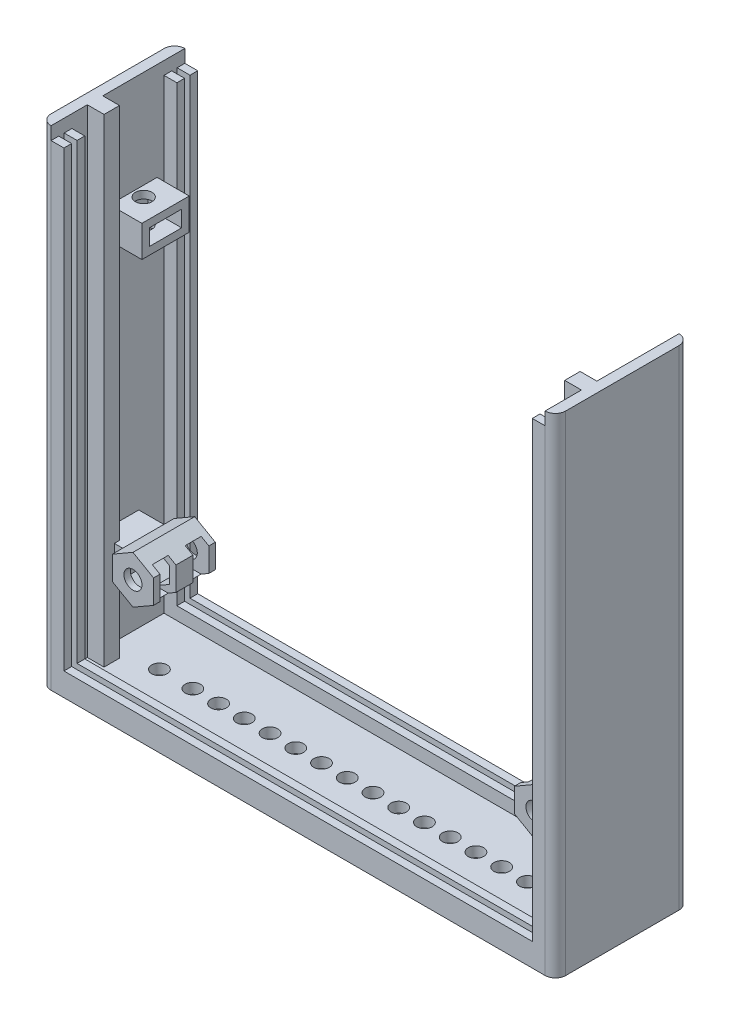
from build123d import *

# Parameters (mm, degrees)
BOSS_EXTRUDE1_DEPTH             = 26
SKETCH2_W                       = 49.25
SKETCH2_H                       = 1.05
CUT_EXTRUDE1_DEPTH              = 95.5
SKETCH3_W                       = 2
SKETCH3_H                       = 3
BOSS_EXTRUDE2_DEPTH             = 93
SKETCH9_R                       = 1.5
CUT_EXTRUDE8_DEPTH              = 113.006975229
SKETCH11_W                      = 26
SKETCH11_H                      = 97
CUT_EXTRUDE9_DEPTH              = 0.25
SKETCH12_W                      = 26
SKETCH12_H                      = 97
CUT_EXTRUDE10_DEPTH             = 0.25
SKETCH15_W                      = 4
SKETCH15_H                      = 40
CUT_EXTRUDE12_DEPTH             = 116.226949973
SKETCH16_W                      = 26
SKETCH16_H                      = 57
CUT_EXTRUDE13_DEPTH             = 1.5
SKETCH17_W                      = 26
SKETCH17_H                      = 57
CUT_EXTRUDE14_DEPTH             = 1.5
SKETCH30_W                      = 2.5
SKETCH30_H                      = 26
CUT_EXTRUDE20_DEPTH             = 84.366660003
SKETCH31_W                      = 2.5
SKETCH31_H                      = 26
CUT_EXTRUDE21_DEPTH             = 84.366660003
BOSS_EXTRUDE4_DEPTH             = 97
MIRROR4_COPY_1_DEPTH            = 97
SKETCH33_W                      = 26
SKETCH33_H                      = 97
CUT_EXTRUDE22_DEPTH             = 2.5
SKETCH34_W                      = 26
SKETCH34_H                      = 97
CUT_EXTRUDE23_DEPTH             = 2.5
BOSS_EXTRUDE5_REACH             = 140.583
BOSS_EXTRUDE5_DIRECTION_2_REACH = 140.583
SKETCH38_W                      = 100
SKETCH38_H                      = 26
CUT_EXTRUDE26_DEPTH             = 2
FILLET1_R                       = 2
BOSS_EXTRUDE8_DEPTH             = 12
BOSS_EXTRUDE9_REACH             = 138.853
SKETCH43_W                      = 8
SKETCH43_H                      = 4.618802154
BOSS_EXTRUDE11_DEPTH            = 1.25
BOSS_EXTRUDE11_DEPTH_BACK       = 5.1
SKETCH47_W                      = 3.1
SKETCH47_H                      = 6.35
CUT_EXTRUDE29_DEPTH             = 3.999997
CUT_EXTRUDE30_DEPTH             = 3.1
SKETCH50_R                      = 1.75
CUT_EXTRUDE31_DEPTH             = 111.761466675
BOSS_EXTRUDE12_DEPTH            = 5.65
SKETCH52_R                      = 1.75
CUT_EXTRUDE32_DEPTH             = 111.778619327
CUT_EXTRUDE33_DEPTH             = 3.1
BOSS_EXTRUDE13_DEPTH            = 12
SKETCH55_W                      = 8
SKETCH55_H                      = 4.618802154
BOSS_EXTRUDE14_DEPTH            = 4.866002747
SKETCH56_W                      = 3.1
SKETCH56_H                      = 6.35
CUT_EXTRUDE34_DEPTH             = 4.000003
BOSS_EXTRUDE15_DEPTH            = 1.25
BOSS_EXTRUDE16_DEPTH            = 1.25
SKETCH59_R                      = 1.75
CUT_EXTRUDE35_DEPTH             = 111.778619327
BOSS_EXTRUDE17_DEPTH            = 1.25
BOSS_EXTRUDE18_DEPTH            = 1.25
SKETCH63_W                      = 6.25
SKETCH63_H                      = 9.2
BOSS_EXTRUDE19_DEPTH            = 6.1
SKETCH64_R                      = 1.6
CUT_EXTRUDE36_DEPTH             = 6.1
SKETCH66_W                      = 6.25
SKETCH66_H                      = 3.15
CUT_EXTRUDE37_DEPTH             = 6.5
SKETCH68_W                      = 6.25
SKETCH68_H                      = 3.15
CUT_EXTRUDE38_DEPTH             = 6.5
SKETCH71_W                      = 6.25
SKETCH71_H                      = 3.15
CUT_EXTRUDE39_DEPTH             = 7
SKETCH73_W                      = 2.5
SKETCH73_H                      = 4.05
CUT_EXTRUDE40_DEPTH             = 2.5


with BuildPart() as part:
    # Sketch1 → Boss-Extrude1 (new body)
    with BuildSketch(Plane.XY):
        Polygon((-56.75, 97), (-56.75, 0), (0, 0), (0, 4), (-48, 4), (-48, 97), align=None)
    extrude(amount=BOSS_EXTRUDE1_DEPTH)

    # Sketch2 → Cut-Extrude1 (cut)
    with BuildSketch(Plane(origin=(0, 97, 0), x_dir=(1, 0, 0), z_dir=(0, 1, 0))):
        with Locations((-24.625, -23.975)):
            Rectangle(SKETCH2_W, SKETCH2_H)
    cut_extrude1 = extrude(amount=-CUT_EXTRUDE1_DEPTH, mode=Mode.SUBTRACT)

    # Mirror1: Cut-Extrude1 across plane
    add(cut_extrude1.mirror(Plane.XY.offset(13)), mode=Mode.SUBTRACT)

    # Sketch3 → Boss-Extrude2 (add)
    with BuildSketch(Plane(origin=(0, 97, 0), x_dir=(1, 0, 0), z_dir=(0, 1, 0))):
        with Locations((-47, -17.45)):
            Rectangle(SKETCH3_W, SKETCH3_H)
    extrude(amount=-BOSS_EXTRUDE2_DEPTH)

    # Mirror2: part across plane


with BuildPart() as part_1:
    add(part.part)
    add(part.part.mirror(Plane(origin=(0, 0, 26), x_dir=(0, 0, 1), z_dir=(-1, 0, 0))))

    # Sketch9 → Cut-Extrude8 (cut, through all)
    with BuildSketch(Plane(origin=(0, 4, 0), x_dir=(1, 0, 0), z_dir=(0, 1, 0))):
        with Locations(Location((42.5, -13.95, 0), (0, 0, 180))):
            Circle(SKETCH9_R)
        with Locations(Location((37.5, -13.95, 0), (0, 0, 180))):
            Circle(SKETCH9_R)
        with Locations(Location((32.5, -13.95, 0), (0, 0, 180))):
            Circle(SKETCH9_R)
        with Locations(Location((27.5, -13.95, 0), (0, 0, 180))):
            Circle(SKETCH9_R)
        with Locations(Location((22.5, -13.95, 0), (0, 0, 180))):
            Circle(SKETCH9_R)
        with Locations(Location((17.5, -13.95, 0), (0, 0, 180))):
            Circle(SKETCH9_R)
        with Locations(Location((12.5, -13.95, 0), (0, 0, 180))):
            Circle(SKETCH9_R)
        with Locations(Location((7.5, -13.95, 0), (0, 0, 180))):
            Circle(SKETCH9_R)
        with Locations(Location((2.5, -13.95, 0), (0, 0, 180))):
            Circle(SKETCH9_R)
        with Locations(Location((-2.5, -13.95, 0), (0, 0, 180))):
            Circle(SKETCH9_R)
        with Locations(Location((-7.5, -13.95, 0), (0, 0, 180))):
            Circle(SKETCH9_R)
        with Locations(Location((-12.5, -13.95, 0), (0, 0, 180))):
            Circle(SKETCH9_R)
        with Locations(Location((-17.5, -13.95, 0), (0, 0, 180))):
            Circle(SKETCH9_R)
        with Locations(Location((-22.5, -13.95, 0), (0, 0, 180))):
            Circle(SKETCH9_R)
        with Locations(Location((-27.5, -13.95, 0), (0, 0, 180))):
            Circle(SKETCH9_R)
        with Locations(Location((-32.5, -13.95, 0), (0, 0, 180))):
            Circle(SKETCH9_R)
        with Locations(Location((-39, -13.95, 0), (0, 0, 180))):
            Circle(SKETCH9_R)
    extrude(amount=-CUT_EXTRUDE8_DEPTH, mode=Mode.SUBTRACT)

    # Sketch11 → Cut-Extrude9 (cut)
    with BuildSketch(Plane.ZY.offset(56.75)):
        with Locations((13, 48.5)):
            Rectangle(SKETCH11_W, SKETCH11_H)
    extrude(amount=-CUT_EXTRUDE9_DEPTH, mode=Mode.SUBTRACT)

    # Sketch12 → Cut-Extrude10 (cut)
    with BuildSketch(Plane(origin=(56.75, 0, 0), x_dir=(0, 0, -1), z_dir=(1, 0, 0))):
        with Locations((-13, 48.5)):
            Rectangle(SKETCH12_W, SKETCH12_H)
    extrude(amount=-CUT_EXTRUDE10_DEPTH, mode=Mode.SUBTRACT)

    # Sketch15 → Cut-Extrude12 (cut, through all)
    with BuildSketch(Plane.XY.offset(26)):
        with Locations((54.5, 77)):
            Rectangle(SKETCH15_W, SKETCH15_H)
        with Locations((-54.5, 77)):
            Rectangle(SKETCH15_W, SKETCH15_H)
    extrude(amount=-CUT_EXTRUDE12_DEPTH, mode=Mode.SUBTRACT)

    # Sketch16 → Cut-Extrude13 (cut)
    with BuildSketch(Plane(origin=(56.5, 0, 0), x_dir=(0, 0, -1), z_dir=(1, 0, 0))):
        with Locations((-13, 28.5)):
            Rectangle(SKETCH16_W, SKETCH16_H)
    extrude(amount=-CUT_EXTRUDE13_DEPTH, mode=Mode.SUBTRACT)

    # Sketch17 → Cut-Extrude14 (cut)
    with BuildSketch(Plane.ZY.offset(56.5)):
        with Locations((13, 28.5)):
            Rectangle(SKETCH17_W, SKETCH17_H)
    extrude(amount=-CUT_EXTRUDE14_DEPTH, mode=Mode.SUBTRACT)

    # Sketch30 → Cut-Extrude20 (cut, through all)
    with BuildSketch(Plane(origin=(0, 57, 0), x_dir=(1, 0, 0), z_dir=(0, 1, 0))):
        with Locations((53.75, -13)):
            Rectangle(SKETCH30_W, SKETCH30_H)
    extrude(amount=-CUT_EXTRUDE20_DEPTH, mode=Mode.SUBTRACT)

    # Sketch31 → Cut-Extrude21 (cut, through all)
    with BuildSketch(Plane(origin=(0, 57, 0), x_dir=(1, 0, 0), z_dir=(0, 1, 0))):
        with Locations((-53.75, -13)):
            Rectangle(SKETCH31_W, SKETCH31_H)
    extrude(amount=-CUT_EXTRUDE21_DEPTH, mode=Mode.SUBTRACT)

    # Sketch32 → Boss-Extrude4 (add, through all)
    with BuildSketch(Plane(origin=(0, 97, 0), x_dir=(1, 0, 0), z_dir=(0, 1, 0))):
        Polygon((-45.5, -24.5), (-45.5, -26), (-49.25, -26), (-49.25, -24.5), (-49.25, -23.975), (-49.25, -23.45), (-49.25, -21.95), (-45.5, -21.95), (-45.5, -23.45), (-48, -23.45), (-48, -24.5), align=None)
    boss_extrude4 = extrude(amount=-BOSS_EXTRUDE4_DEPTH)

    # Mirror3: Boss-Extrude4 across plane
    add(boss_extrude4.mirror(Plane.XY.offset(13)))

    # Mirror4: Boss-Extrude4 across plane
    add(boss_extrude4.mirror(Plane(origin=(0, 0, 0), x_dir=(0, 0, 1), z_dir=(1, 0, 0))))

    # Mirror4 copy 1 sketch → Mirror4 copy 1 (add, through all)
    with BuildSketch(Plane(origin=(0, 97, 26), x_dir=(-1, 0, 0), z_dir=(0, 1, 0))):
        Polygon((-45.5, -24.5), (-45.5, -26), (-49.25, -26), (-49.25, -24.5), (-49.25, -23.975), (-49.25, -23.45), (-49.25, -21.95), (-45.5, -21.95), (-45.5, -23.45), (-48, -23.45), (-48, -24.5), align=None)
    extrude(amount=-MIRROR4_COPY_1_DEPTH)

    # Sketch33 → Cut-Extrude22 (cut)
    with BuildSketch(Plane.ZY.offset(52.5)):
        with Locations((13, 48.5)):
            Rectangle(SKETCH33_W, SKETCH33_H)
    extrude(amount=-CUT_EXTRUDE22_DEPTH, mode=Mode.SUBTRACT)

    # Sketch34 → Cut-Extrude23 (cut)
    with BuildSketch(Plane(origin=(52.5, 0, 0), x_dir=(0, 0, -1), z_dir=(1, 0, 0))):
        with Locations((-13, 48.5)):
            Rectangle(SKETCH34_W, SKETCH34_H)
    extrude(amount=-CUT_EXTRUDE23_DEPTH, mode=Mode.SUBTRACT)

    # Boss-Extrude5: up to this face of the body (flat: up to its plane)
    boss_extrude5_end = Plane(part_1.part.faces().sort_by_distance((48, 49.25, 23.975))[0])
    # Sketch35 → Boss-Extrude5 (add, up to the picked face)
    with BuildSketch(Plane(origin=(-45.5, 0, 0), x_dir=(0, 0, -1), z_dir=(1, 0, 0)), mode=Mode.PRIVATE) as boss_extrude5_sk1:
        Polygon((-26, 6.5), (-26, 0), (-21.95, 0), (-21.95, 6.5), (-23.45, 6.5), (-23.45, 4), (-24.5, 4), (-24.5, 6.5), align=None)
    boss_extrude5_tool1 = split(extrude(boss_extrude5_sk1.sketch, amount=BOSS_EXTRUDE5_REACH, mode=Mode.PRIVATE), bisect_by=boss_extrude5_end, keep=Keep.BOTH, mode=Mode.PRIVATE)
    boss_extrude5 = boss_extrude5_tool1.solids().sort_by(Axis((-45.5, 3.028481, 23.975), (1, 0, 0)))[0]
    add(boss_extrude5)

    # Boss-Extrude5 direction 2: up to this face of the body (flat: up to its plane)
    boss_extrude5_direction_2_end = Plane(part_1.part.faces().sort_by_distance((-48, 49.25, 23.975))[0])
    # Sketch35 → Boss-Extrude5 direction 2 (add, up to the picked face)
    with BuildSketch(Plane(origin=(-45.5, 0, 0), x_dir=(0, 0, -1), z_dir=(1, 0, 0)), mode=Mode.PRIVATE) as boss_extrude5_direction_2_sk1:
        Polygon((-26, 6.5), (-26, 0), (-21.95, 0), (-21.95, 6.5), (-23.45, 6.5), (-23.45, 4), (-24.5, 4), (-24.5, 6.5), align=None)
    boss_extrude5_direction_2_tool1 = split(extrude(boss_extrude5_direction_2_sk1.sketch, amount=-BOSS_EXTRUDE5_DIRECTION_2_REACH, mode=Mode.PRIVATE), bisect_by=boss_extrude5_direction_2_end, keep=Keep.BOTH, mode=Mode.PRIVATE)
    boss_extrude5_direction_2 = boss_extrude5_direction_2_tool1.solids().sort_by(Axis((-45.5, 3.028481, 23.975), (-1, 0, 0)))[0]
    add(boss_extrude5_direction_2)

    # Mirror5: Boss-Extrude5, Boss-Extrude5 direction 2 across plane
    add(boss_extrude5.mirror(Plane.XY.offset(13)))
    add(boss_extrude5_direction_2.mirror(Plane.XY.offset(13)))

    # Sketch38 → Cut-Extrude26 (cut)
    with BuildSketch(Plane.XZ):
        with Locations((0, 13)):
            Rectangle(SKETCH38_W, SKETCH38_H)
    extrude(amount=-CUT_EXTRUDE26_DEPTH, mode=Mode.SUBTRACT)

    # Fillet1
    fillet1_edges = [part_1.edges().sort_by_distance(p)[0] for p in [
        (-50, 49.5, 0),
        (50, 49.5, 26),
        (50, 49.5, 0),
        (-50, 49.5, 26),
    ]]
    fillet(fillet1_edges, radius=FILLET1_R)

    # Boss-Extrude9: up to this face of the body (flat: up to its plane)
    boss_extrude9_end = Plane(part_1.part.faces().sort_by_distance((48, 50.5, 10))[0])
    # Sketch43 → Boss-Extrude9 (add, up to the picked face)
    with BuildSketch(Plane(origin=(42.971002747, 0, 0), x_dir=(0, 0, -1), z_dir=(1, 0, 0)), mode=Mode.PRIVATE) as boss_extrude9_sk1:
        with Locations((-12.95, 21.505999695)):
            Rectangle(SKETCH43_W, SKETCH43_H)
    boss_extrude9_tool1 = split(extrude(boss_extrude9_sk1.sketch, amount=BOSS_EXTRUDE9_REACH, mode=Mode.PRIVATE), bisect_by=boss_extrude9_end, keep=Keep.BOTH, mode=Mode.PRIVATE)


with BuildPart() as body_2:
    # Sketch42 → Boss-Extrude8 (new body)
    with BuildSketch(Plane.XY.offset(18.95)):
        Polygon((42.971002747, 23.815400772), (38.971002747, 26.124801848), (34.971002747, 23.815400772), (34.971002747, 19.196598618), (38.971002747, 16.887197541), (42.971002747, 19.196598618), align=None)
        Polygon((41.721002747, 23.093712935), (38.971002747, 24.681426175), (36.221002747, 23.093712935), (36.221002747, 19.918286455), (38.971002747, 18.330573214), (41.721002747, 19.918286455), align=None, mode=Mode.SUBTRACT)
    extrude(amount=-BOSS_EXTRUDE8_DEPTH)


with BuildPart() as part_2:
    add(part_1.part)

    add(body_2.part)  # Boss-Extrude9 merges body 2
    add(boss_extrude9_tool1.solids().sort_by(Axis((42.971003, 21.506, 12.95), (1, 0, 0)))[0])

    # Sketch48 → Boss-Extrude11 (add, two sides: drawn at the far end of the back side and taken through both)
    with BuildSketch(Plane.XY.offset(17.7).offset(-BOSS_EXTRUDE11_DEPTH_BACK)):
        Polygon((38.971002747, 24.681426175), (36.221002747, 23.093712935), (36.221002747, 19.918286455), (38.971002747, 18.330573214), (41.721002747, 19.918286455), (41.721002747, 23.093712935), align=None)
    extrude(amount=BOSS_EXTRUDE11_DEPTH + BOSS_EXTRUDE11_DEPTH_BACK)

    # Sketch47 → Cut-Extrude29 (cut)
    with BuildSketch(Plane.ZY.offset(-34.971002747)):
        with Locations((16.15, 21.505999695)):
            Rectangle(SKETCH47_W, SKETCH47_H)
        with Locations((9.75, 21.505999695)):
            Rectangle(SKETCH47_W, SKETCH47_H)
    extrude(amount=-CUT_EXTRUDE29_DEPTH, mode=Mode.SUBTRACT)

    # Sketch49 → Cut-Extrude30 (cut)
    with BuildSketch(Plane.XY.offset(14.6)):
        Polygon((38.971002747, 24.681426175), (36.221002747, 23.093712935), (36.221002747, 19.918286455), (38.971002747, 18.330573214), (41.721002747, 19.918286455), (41.721002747, 23.093712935), align=None)
    extrude(amount=CUT_EXTRUDE30_DEPTH, mode=Mode.SUBTRACT)

    # Sketch50 → Cut-Extrude31 (cut, through all)
    with BuildSketch(Plane.XY.offset(18.95)):
        with Locations((38.971002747, 21.505999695)):
            Circle(SKETCH50_R)
    extrude(amount=-CUT_EXTRUDE31_DEPTH, mode=Mode.SUBTRACT)

    # Sketch51 → Boss-Extrude12 (add)
    with BuildSketch(Plane(origin=(0, 0, 12.6), x_dir=(-1, 0, 0), z_dir=(0, 0, -1))):
        Polygon((-38.971002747, 24.681426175), (-41.721002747, 23.093712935), (-41.721002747, 19.918286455), (-38.971002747, 18.330573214), (-36.221002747, 19.918286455), (-36.221002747, 23.093712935), align=None)
    extrude(amount=BOSS_EXTRUDE12_DEPTH)

    # Sketch52 → Cut-Extrude32 (cut, through all)
    with BuildSketch(Plane(origin=(0, 0, 6.95), x_dir=(-1, 0, 0), z_dir=(0, 0, -1))):
        with Locations((-38.971002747, 21.505999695)):
            Circle(SKETCH52_R)
    extrude(amount=-CUT_EXTRUDE32_DEPTH, mode=Mode.SUBTRACT)

    # Sketch53 → Cut-Extrude33 (cut)
    with BuildSketch(Plane.XY.offset(8.2)):
        Polygon((38.971002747, 24.681426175), (36.221002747, 23.093712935), (36.221002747, 19.918286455), (38.971002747, 18.330573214), (41.721002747, 19.918286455), (41.721002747, 23.093712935), align=None)
    extrude(amount=CUT_EXTRUDE33_DEPTH, mode=Mode.SUBTRACT)



with BuildPart() as body_2_2:
    # Sketch54 → Boss-Extrude13 (new body)
    with BuildSketch(Plane.XY.offset(18.95)):
        Polygon((-39.133997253, 26.124801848), (-43.133997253, 23.815400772), (-43.133997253, 19.196598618), (-39.133997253, 16.887197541), (-35.133997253, 19.196598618), (-35.133997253, 23.815400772), align=None)
        Polygon((-39.133997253, 24.681426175), (-41.883997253, 23.093712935), (-41.883997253, 19.918286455), (-39.133997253, 18.330573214), (-36.383997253, 19.918286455), (-36.383997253, 23.093712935), align=None, mode=Mode.SUBTRACT)
    extrude(amount=-BOSS_EXTRUDE13_DEPTH)


with BuildPart() as part_3:
    add(part_2.part)

    add(body_2_2.part)  # Boss-Extrude14 merges body 2 2
    # Sketch55 → Boss-Extrude14 (add)
    with BuildSketch(Plane.ZY.offset(43.133997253)):
        with Locations((12.95, 21.505999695)):
            Rectangle(SKETCH55_W, SKETCH55_H)
    extrude(amount=BOSS_EXTRUDE14_DEPTH)

    # Sketch56 → Cut-Extrude34 (cut)
    with BuildSketch(Plane(origin=(-35.133997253, 0, 0), x_dir=(0, 0, -1), z_dir=(1, 0, 0))):
        with Locations((-16.15, 21.505999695)):
            Rectangle(SKETCH56_W, SKETCH56_H)
        with Locations((-9.75, 21.505999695)):
            Rectangle(SKETCH56_W, SKETCH56_H)
    extrude(amount=-CUT_EXTRUDE34_DEPTH, mode=Mode.SUBTRACT)

    # Sketch57 → Boss-Extrude15 (add)
    with BuildSketch(Plane(origin=(0, 0, 6.95), x_dir=(-1, 0, 0), z_dir=(0, 0, -1))):
        Polygon((39.133997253, 24.681426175), (36.383997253, 23.093712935), (36.383997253, 19.918286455), (39.133997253, 18.330573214), (41.883997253, 19.918286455), (41.883997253, 23.093712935), align=None)
    extrude(amount=-BOSS_EXTRUDE15_DEPTH)

    # Sketch58 → Boss-Extrude16 (add)
    with BuildSketch(Plane.XY.offset(18.95)):
        Polygon((-36.383997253, 19.918286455), (-36.383997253, 23.093712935), (-39.133997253, 24.681426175), (-41.883997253, 23.093712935), (-41.883997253, 19.918286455), (-39.133997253, 18.330573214), align=None)
    extrude(amount=-BOSS_EXTRUDE16_DEPTH)

    # Sketch59 → Cut-Extrude35 (cut, through all)
    with BuildSketch(Plane(origin=(0, 0, 6.95), x_dir=(-1, 0, 0), z_dir=(0, 0, -1))):
        with Locations(Location((39.133997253, 21.505999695, 0), (0, 0, 180))):
            Circle(SKETCH59_R)
    extrude(amount=-CUT_EXTRUDE35_DEPTH, mode=Mode.SUBTRACT)

    # Sketch61 → Boss-Extrude17 (add)
    with BuildSketch(Plane(origin=(-46, 0, 0), x_dir=(0, 0, -1), z_dir=(1, 0, 0))):
        Polygon((-16.95, 19.196598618), (-16.95, 23.815400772), (-15.95, 23.815400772), (-15.95, 97), (-18.95, 97), (-18.95, 4), (-15.95, 4), (-15.95, 19.196598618), align=None)
    extrude(amount=BOSS_EXTRUDE17_DEPTH)

    # Sketch62 → Boss-Extrude18 (add)
    with BuildSketch(Plane.ZY.offset(-46)):
        Polygon((15.95, 97), (15.95, 23.815400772), (16.95, 23.815400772), (16.95, 19.196598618), (15.95, 19.196598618), (15.95, 4), (18.95, 4), (18.95, 97), align=None)
    extrude(amount=BOSS_EXTRUDE18_DEPTH)

    # Sketch63 → Boss-Extrude19 (add)
    with BuildSketch(Plane(origin=(0, 78, 0), x_dir=(1, 0, 0), z_dir=(0, 1, 0))):
        with Locations((44.875, -10)):
            Rectangle(SKETCH63_W, SKETCH63_H)
    boss_extrude19 = extrude(amount=-BOSS_EXTRUDE19_DEPTH)

    # Sketch64 → Cut-Extrude36 (cut)
    with BuildSketch(Plane(origin=(0, 78, 0), x_dir=(1, 0, 0), z_dir=(0, 1, 0))):
        with Locations(Location((46, -10, 0), (0, 0, 270))):
            Circle(SKETCH64_R)
    cut_extrude36 = extrude(amount=-CUT_EXTRUDE36_DEPTH, mode=Mode.SUBTRACT)

    # Sketch66 → Cut-Extrude37 (cut)
    with BuildSketch(Plane.ZY.offset(-41.75)):
        with Locations((10, 74.95)):
            Rectangle(SKETCH66_W, SKETCH66_H)
    extrude(amount=-CUT_EXTRUDE37_DEPTH, mode=Mode.SUBTRACT)

    # Mirror7: Boss-Extrude19, Cut-Extrude36 across plane
    add(boss_extrude19.mirror(Plane(origin=(0, 0, 0), x_dir=(0, 0, 1), z_dir=(1, 0, 0))))
    add(cut_extrude36.mirror(Plane(origin=(0, 0, 0), x_dir=(0, 0, 1), z_dir=(1, 0, 0))), mode=Mode.SUBTRACT)

    # Sketch68 → Cut-Extrude38 (cut)
    with BuildSketch(Plane(origin=(-41.75, 0, 0), x_dir=(0, 0, -1), z_dir=(1, 0, 0))):
        with Locations((-10, 74.95)):
            Rectangle(SKETCH68_W, SKETCH68_H)
    extrude(amount=-CUT_EXTRUDE38_DEPTH, mode=Mode.SUBTRACT)

    # Sketch71 → Cut-Extrude39 (cut)
    with BuildSketch(Plane.ZY.offset(-41.75)):
        with Locations((10, 74.95)):
            Rectangle(SKETCH71_W, SKETCH71_H)
    extrude(amount=-CUT_EXTRUDE39_DEPTH, mode=Mode.SUBTRACT)

    # Sketch73 → Cut-Extrude40 (cut)
    with BuildSketch(Plane(origin=(0, 97, 0), x_dir=(1, 0, 0), z_dir=(0, 1, 0))):
        with Locations((46.75, -2.025)):
            Rectangle(SKETCH73_W, SKETCH73_H)
        with Locations((-46.75, -2.025)):
            Rectangle(SKETCH73_W, SKETCH73_H)
        with Locations((-46.75, -23.975)):
            Rectangle(SKETCH73_W, SKETCH73_H)
        with Locations((46.75, -23.975)):
            Rectangle(SKETCH73_W, SKETCH73_H)
    extrude(amount=-CUT_EXTRUDE40_DEPTH, mode=Mode.SUBTRACT)


solid = part_3.part
